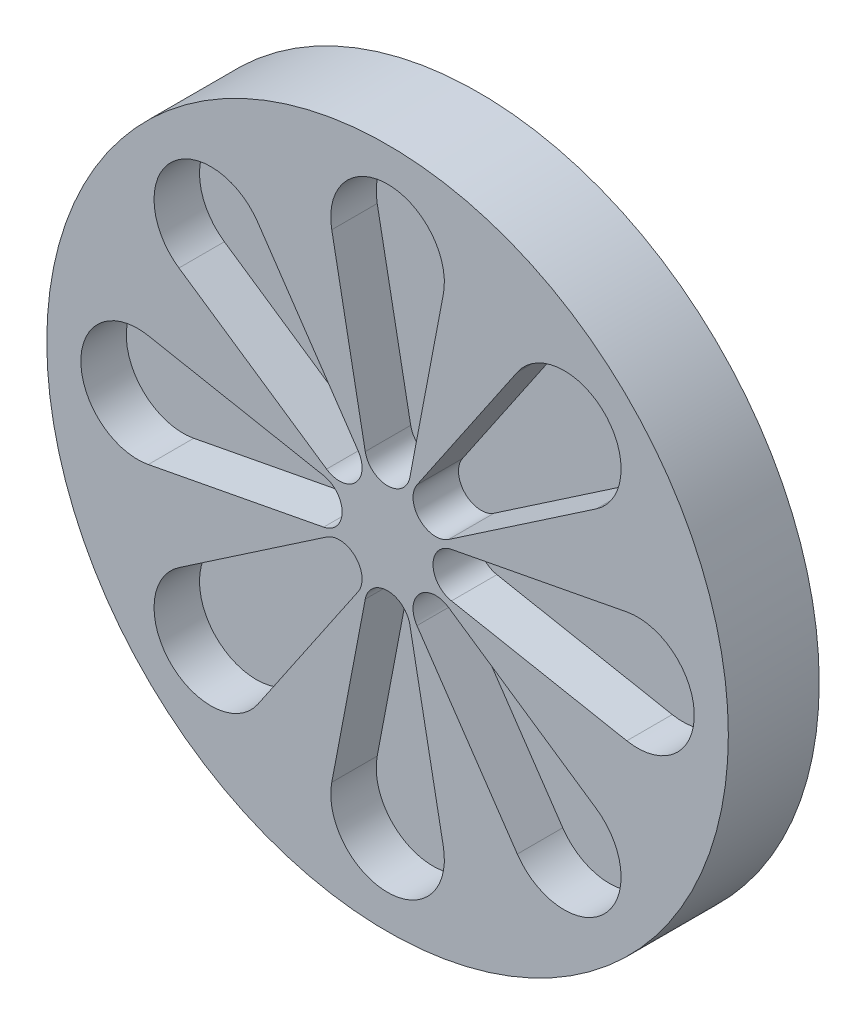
from build123d import *

# Parameters (mm, degrees)
SKETCH1_R          = 150
EXTRUDE1_DEPTH     = 40
CUT_EXTRUDE1_DEPTH = 20


with BuildPart() as part:
    # Sketch1 → Extrude1 (new body)
    with BuildSketch(Plane.XY):
        Circle(SKETCH1_R)
    extrude(amount=EXTRUDE1_DEPTH)

    # Sketch2 → Cut-Extrude1 (cut)
    with BuildSketch(Plane.XY.offset(40)):
        with BuildLine():
            Line((105.3125, 24.556615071), (28.125, 9.822646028))
            ThreePointArc((28.125, 9.822646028), (20, 0), (28.125, -9.822646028))
            Line((28.125, -9.822646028), (105.3125, -24.556615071))
            ThreePointArc((105.3125, -24.556615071), (135, 0), (105.3125, 24.556615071))
        make_face()
        with BuildLine():
            Line((12.941718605, -26.833037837), (57.103033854, -91.831331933))
            ThreePointArc((57.103033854, -91.831331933), (95.45941546, -95.45941546), (91.831331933, -57.103033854))
            Line((91.831331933, -57.103033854), (26.833037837, -12.941718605))
            ThreePointArc((26.833037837, -12.941718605), (14.142135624, -14.142135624), (12.941718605, -26.833037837))
        make_face()
        with BuildLine():
            Line((-9.822646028, -28.125), (-24.556615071, -105.3125))
            ThreePointArc((-24.556615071, -105.3125), (0, -135), (24.556615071, -105.3125))
            Line((24.556615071, -105.3125), (9.822646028, -28.125))
            ThreePointArc((9.822646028, -28.125), (0, -20), (-9.822646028, -28.125))
        make_face()
        with BuildLine():
            Line((-26.833037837, -12.941718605), (-91.831331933, -57.103033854))
            ThreePointArc((-91.831331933, -57.103033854), (-95.45941546, -95.45941546), (-57.103033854, -91.831331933))
            Line((-57.103033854, -91.831331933), (-12.941718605, -26.833037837))
            ThreePointArc((-12.941718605, -26.833037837), (-14.142135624, -14.142135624), (-26.833037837, -12.941718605))
        make_face()
        with BuildLine():
            Line((-28.125, 9.822646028), (-105.3125, 24.556615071))
            ThreePointArc((-105.3125, 24.556615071), (-135, 0), (-105.3125, -24.556615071))
            Line((-105.3125, -24.556615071), (-28.125, -9.822646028))
            ThreePointArc((-28.125, -9.822646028), (-20, 0), (-28.125, 9.822646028))
        make_face()
        with BuildLine():
            Line((-12.941718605, 26.833037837), (-57.103033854, 91.831331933))
            ThreePointArc((-57.103033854, 91.831331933), (-95.45941546, 95.45941546), (-91.831331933, 57.103033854))
            Line((-91.831331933, 57.103033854), (-26.833037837, 12.941718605))
            ThreePointArc((-26.833037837, 12.941718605), (-14.142135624, 14.142135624), (-12.941718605, 26.833037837))
        make_face()
        with BuildLine():
            Line((9.822646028, 28.125), (24.556615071, 105.3125))
            ThreePointArc((24.556615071, 105.3125), (0, 135), (-24.556615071, 105.3125))
            Line((-24.556615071, 105.3125), (-9.822646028, 28.125))
            ThreePointArc((-9.822646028, 28.125), (0, 20), (9.822646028, 28.125))
        make_face()
        with BuildLine():
            Line((26.833037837, 12.941718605), (91.831331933, 57.103033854))
            ThreePointArc((91.831331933, 57.103033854), (95.45941546, 95.45941546), (57.103033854, 91.831331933))
            Line((57.103033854, 91.831331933), (12.941718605, 26.833037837))
            ThreePointArc((12.941718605, 26.833037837), (14.142135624, 14.142135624), (26.833037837, 12.941718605))
        make_face()
    extrude(amount=-CUT_EXTRUDE1_DEPTH, mode=Mode.SUBTRACT)


solid = part.part
